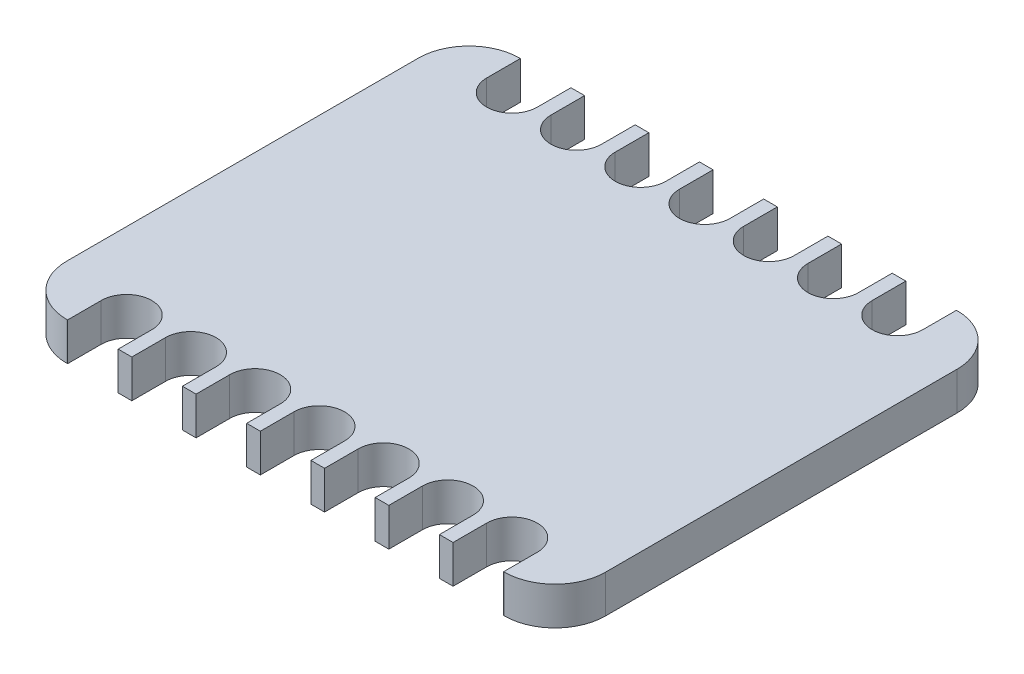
from build123d import *

# Parameters (mm, degrees)
BOSS_EXTRUDE1_DEPTH = 1.5


with BuildPart() as part:
    # Sketch1 → Boss-Extrude1 (new body)
    with BuildSketch(Plane(origin=(0, 0, 0), x_dir=(1, 0, 0), z_dir=(0, 1, 0))):
        with BuildLine():
            Line((-10.65, 6.95), (-10.65, -6.95))
            ThreePointArc((-10.65, -6.95), (-10.064213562, -8.364213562), (-8.65, -8.95))
            Line((-8.65, -8.95), (-8.62, -8.95))
            Line((-8.62, -8.95), (-8.62, -7.62))
            ThreePointArc((-8.62, -7.62), (-7.62, -6.62), (-6.62, -7.62))
            Line((-6.62, -7.62), (-6.62, -8.95))
            Line((-6.62, -8.95), (-6.08, -8.95))
            Line((-6.08, -8.95), (-6.08, -7.62))
            ThreePointArc((-6.08, -7.62), (-5.08, -6.62), (-4.08, -7.62))
            Line((-4.08, -7.62), (-4.08, -8.95))
            Line((-4.08, -8.95), (-3.54, -8.95))
            Line((-3.54, -8.95), (-3.54, -7.62))
            ThreePointArc((-3.54, -7.62), (-2.54, -6.62), (-1.54, -7.62))
            Line((-1.54, -7.62), (-1.54, -8.95))
            Line((-1.54, -8.95), (-1, -8.95))
            Line((-1, -8.95), (-1, -7.62))
            ThreePointArc((-1, -7.62), (0, -6.62), (1, -7.62))
            Line((1, -7.62), (1, -8.95))
            Line((1, -8.95), (1.54, -8.95))
            Line((1.54, -8.95), (1.54, -7.62))
            ThreePointArc((1.54, -7.62), (2.54, -6.62), (3.54, -7.62))
            Line((3.54, -7.62), (3.54, -8.95))
            Line((3.54, -8.95), (4.08, -8.95))
            Line((4.08, -8.95), (4.08, -7.62))
            ThreePointArc((4.08, -7.62), (5.08, -6.62), (6.08, -7.62))
            Line((6.08, -7.62), (6.08, -8.95))
            Line((6.08, -8.95), (6.62, -8.95))
            Line((6.62, -8.95), (6.62, -7.62))
            ThreePointArc((6.62, -7.62), (7.62, -6.62), (8.62, -7.62))
            Line((8.62, -7.62), (8.62, -8.95))
            Line((8.62, -8.95), (8.65, -8.95))
            ThreePointArc((8.65, -8.95), (10.064213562, -8.364213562), (10.65, -6.95))
            Line((10.65, -6.95), (10.65, 6.95))
            ThreePointArc((10.65, 6.95), (10.064213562, 8.364213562), (8.65, 8.95))
            Line((8.65, 8.95), (8.62, 8.95))
            Line((8.62, 8.95), (8.62, 7.62))
            ThreePointArc((8.62, 7.62), (7.62, 6.62), (6.62, 7.62))
            Line((6.62, 7.62), (6.62, 8.95))
            Line((6.62, 8.95), (6.08, 8.95))
            Line((6.08, 8.95), (6.08, 7.62))
            ThreePointArc((6.08, 7.62), (5.08, 6.62), (4.08, 7.62))
            Line((4.08, 7.62), (4.08, 8.95))
            Line((4.08, 8.95), (3.54, 8.95))
            Line((3.54, 8.95), (3.54, 7.62))
            ThreePointArc((3.54, 7.62), (2.54, 6.62), (1.54, 7.62))
            Line((1.54, 7.62), (1.54, 8.95))
            Line((1.54, 8.95), (1, 8.95))
            Line((1, 8.95), (1, 7.62))
            ThreePointArc((1, 7.62), (0, 6.62), (-1, 7.62))
            Line((-1, 7.62), (-1, 8.95))
            Line((-1, 8.95), (-1.54, 8.95))
            Line((-1.54, 8.95), (-1.54, 7.62))
            ThreePointArc((-1.54, 7.62), (-2.54, 6.62), (-3.54, 7.62))
            Line((-3.54, 7.62), (-3.54, 8.95))
            Line((-3.54, 8.95), (-4.08, 8.95))
            Line((-4.08, 8.95), (-4.08, 7.62))
            ThreePointArc((-4.08, 7.62), (-5.08, 6.62), (-6.08, 7.62))
            Line((-6.08, 7.62), (-6.08, 8.95))
            Line((-6.08, 8.95), (-6.62, 8.95))
            Line((-6.62, 8.95), (-6.62, 7.62))
            ThreePointArc((-6.62, 7.62), (-7.62, 6.62), (-8.62, 7.62))
            Line((-8.62, 7.62), (-8.62, 8.95))
            Line((-8.62, 8.95), (-8.65, 8.95))
            ThreePointArc((-8.65, 8.95), (-10.064213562, 8.364213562), (-10.65, 6.95))
        make_face()
    extrude(amount=BOSS_EXTRUDE1_DEPTH)


solid = part.part
